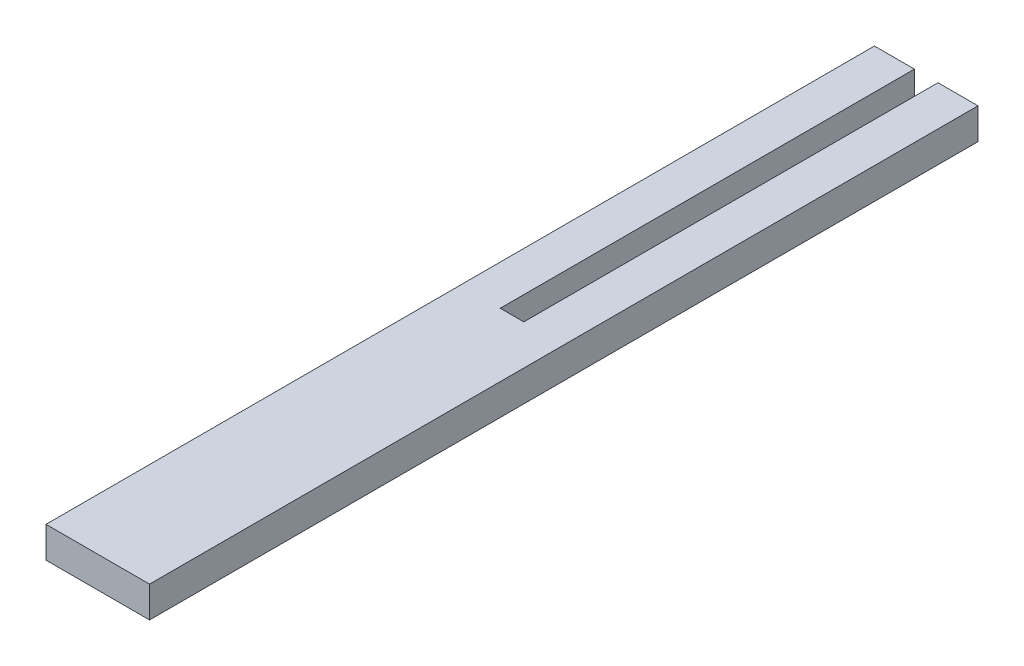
from build123d import *

# Parameters (mm, degrees)
SKETCH1_W           = 10
SKETCH1_H           = 80
BOSS_EXTRUDE1_DEPTH = 3
SKETCH2_W           = 2.28
SKETCH2_H           = 80
CUT_EXTRUDE2_DEPTH  = 3


with BuildPart() as part:
    # Sketch1 → Boss-Extrude1 (new body)
    with BuildSketch(Plane(origin=(0, 0, 0), x_dir=(1, 0, 0), z_dir=(0, 1, 0))):
        Rectangle(SKETCH1_W, SKETCH1_H)
    extrude(amount=-BOSS_EXTRUDE1_DEPTH)

    # Sketch2 → Cut-Extrude2 (cut)
    with BuildSketch(Plane(origin=(0, 0, 0), x_dir=(1, 0, 0), z_dir=(0, 1, 0))):
        with Locations((0, 40)):
            Rectangle(SKETCH2_W, SKETCH2_H)
    extrude(amount=-CUT_EXTRUDE2_DEPTH, mode=Mode.SUBTRACT)


solid = part.part
